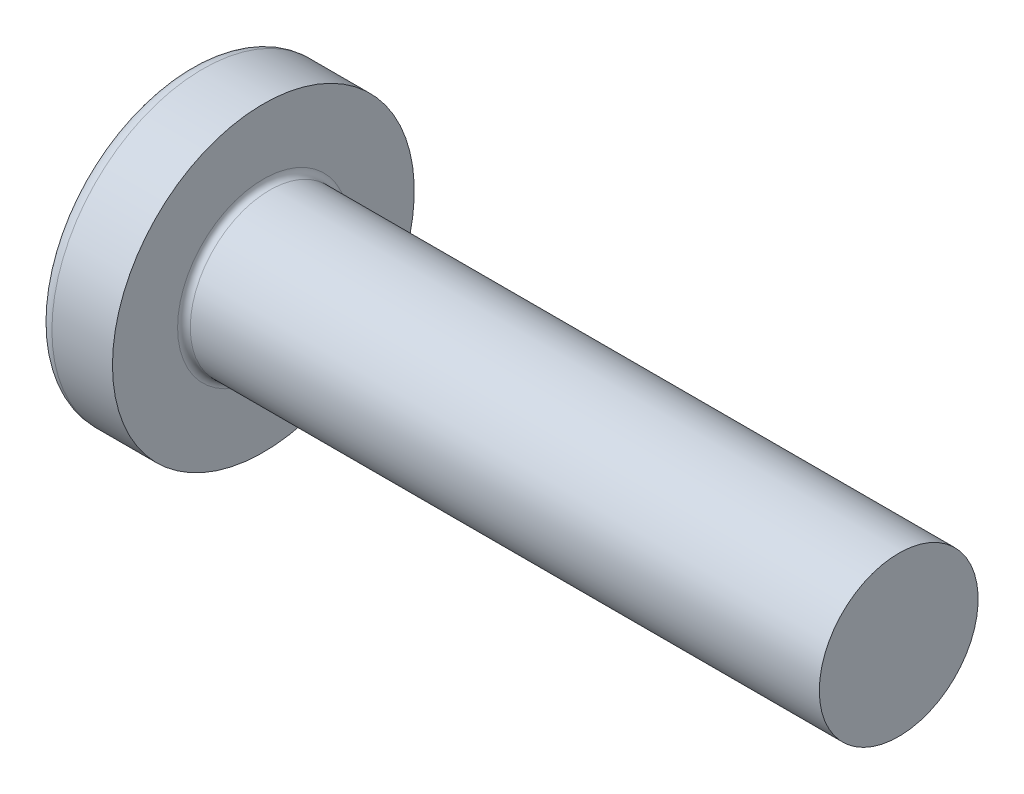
from build123d import *

# Parameters (mm, degrees)
FILLET1_R    = 0.2
RECPAT_COUNT = 2
RECPAT_ANGLE = 90


with BuildPart() as part:
    # BodySke → Base-Revolve (revolve)
    with BuildSketch(Plane.XY, mode=Mode.PRIVATE) as base_revolve_sk:
        with BuildLine():
            Line((3.7, 2.5), (3.7, 4.75))
            Line((3.7, 4.75), (1.79415598, 4.75))
            ThreePointArc((1.79415598, 4.75), (1.58538712, 4.698642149), (1.424271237, 4.556291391))
            ThreePointArc((1.424271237, 4.556291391), (0.364365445, 2.386856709), (0, 0))
            Line((0, 0), (23.7, 0))
            Line((23.7, 0), (23.7, 2.5))
            Line((23.7, 2.5), (3.7, 2.5))
        make_face()
    revolve(base_revolve_sk.sketch.rotate(Axis((1.79415598, 0, 0), (1, 0, 0)), 90), axis=Axis((1.79415598, 0, 0), (1, 0, 0)))

    # Fillet1
    fillet1_edges = [part.edges().sort_by_distance(p)[0] for p in [
        (3.7, 0, -2.5),
    ]]
    fillet(fillet1_edges, radius=FILLET1_R)

    # Sketch3 → Recess section 0
    with BuildSketch(Plane(origin=(0, 0, 0), x_dir=(0, 0, -1), z_dir=(1, 0, 0))):
        with BuildLine():
            Line((0.515, -2.35), (-0.515, -2.35))
            Line((-0.515, -2.35), (-0.515, 2.35))
            Line((-0.515, 2.35), (0.515, 2.35))
            Line((0.515, 2.35), (0.515, -2.35))
        make_face()
    # Sketch4 → Recess section 1
    with BuildSketch(Plane(origin=(2.74, 0, 0), x_dir=(0, 0, -1), z_dir=(1, 0, 0))):
        with BuildLine():
            Line((0.515, -0.983886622), (-0.515, -0.983886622))
            Line((-0.515, -0.983886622), (-0.515, 0.983886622))
            Line((-0.515, 0.983886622), (0.515, 0.983886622))
            Line((0.515, 0.983886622), (0.515, -0.983886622))
        make_face()
    recess = loft(mode=Mode.SUBTRACT)

    # RecPat: Recess ×2 about axis
    recpat_axis = Axis((0, 0, 0), (1, 0, 0))
    for i in range(1, RECPAT_COUNT):
        add(recess.rotate(recpat_axis, i * RECPAT_ANGLE / (RECPAT_COUNT - 1)), mode=Mode.SUBTRACT)

    # RecCorSke → RecessCore (revolve, cut)
    with BuildSketch(Plane.XY, mode=Mode.PRIVATE) as recesscore_sk:
        Polygon((0, 0), (0, 1.042599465), (2.74, 0.851), (3.016506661, 0), align=None)
    revolve(recesscore_sk.sketch.rotate(Axis((-3.175, 0, 0), (1, 0, 0)), 13.238159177), axis=Axis((-3.175, 0, 0), (1, 0, 0)), mode=Mode.SUBTRACT)


solid = part.part
